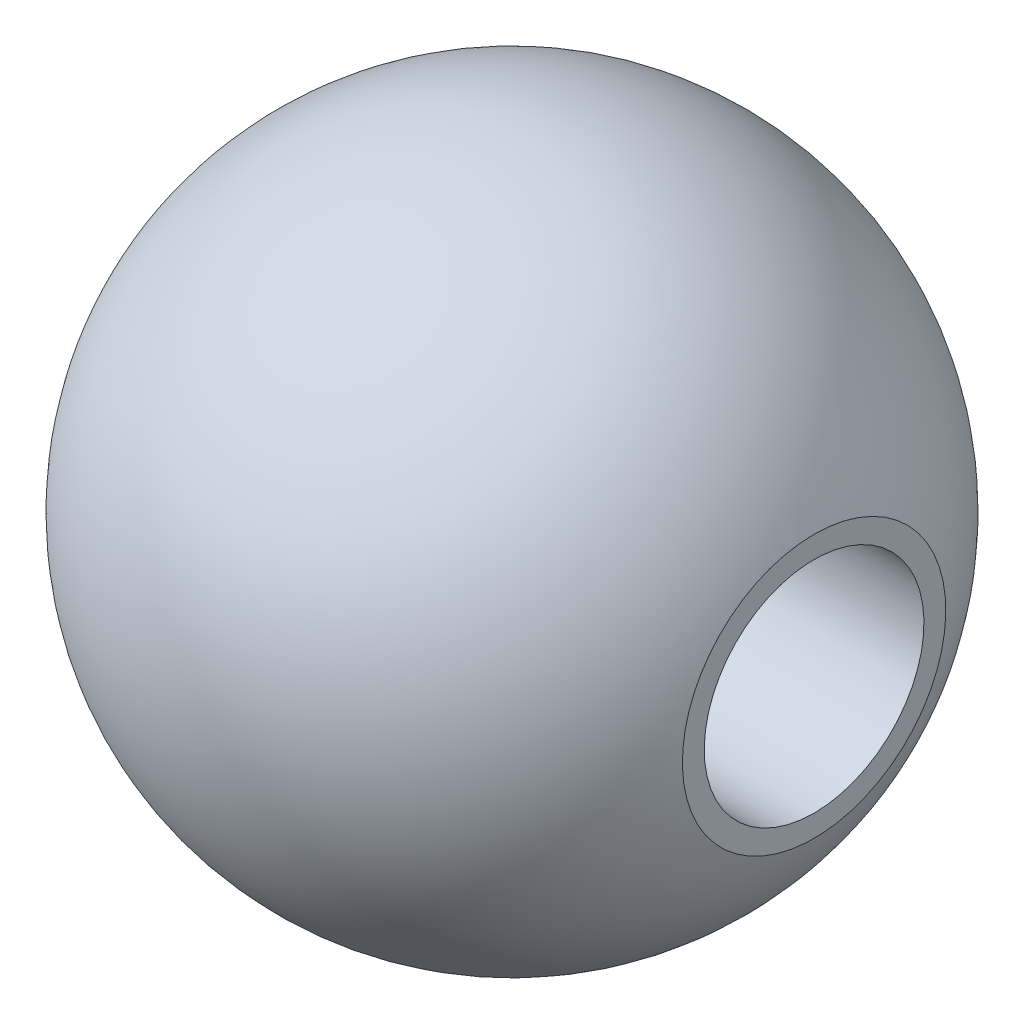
ISO-10303-21;
HEADER;
FILE_DESCRIPTION(('STEP AP214'),'2;1');
FILE_NAME('part.step','',(''),(''),'','','');
FILE_SCHEMA(('AUTOMOTIVE_DESIGN { 1 0 10303 214 1 1 1 1 }'));
ENDSEC;
DATA;
#1=APPLICATION_CONTEXT('core data for automotive mechanical design processes');
#2=APPLICATION_PROTOCOL_DEFINITION('international standard','automotive_design',2000,#1);
#3=PRODUCT_CONTEXT('',#1,'mechanical');
#4=PRODUCT('Part','Part','',(#3));
#5=PRODUCT_RELATED_PRODUCT_CATEGORY('part','',(#4));
#6=PRODUCT_DEFINITION_FORMATION('','',#4);
#7=PRODUCT_DEFINITION_CONTEXT('part definition',#1,'design');
#8=PRODUCT_DEFINITION('design','',#6,#7);
#9=PRODUCT_DEFINITION_SHAPE('','',#8);
#10=(LENGTH_UNIT() NAMED_UNIT(*) SI_UNIT(.MILLI.,.METRE.));
#11=(NAMED_UNIT(*) PLANE_ANGLE_UNIT() SI_UNIT($,.RADIAN.));
#12=(NAMED_UNIT(*) SI_UNIT($,.STERADIAN.) SOLID_ANGLE_UNIT());
#13=UNCERTAINTY_MEASURE_WITH_UNIT(LENGTH_MEASURE(1.E-05),#10,'distance_accuracy_value','');
#14=(GEOMETRIC_REPRESENTATION_CONTEXT(3) GLOBAL_UNCERTAINTY_ASSIGNED_CONTEXT((#13)) GLOBAL_UNIT_ASSIGNED_CONTEXT((#10,
#11,#12)) REPRESENTATION_CONTEXT('',''));
#15=CARTESIAN_POINT('',(0.,0.,0.));
#16=DIRECTION('',(0.,0.,1.));
#17=DIRECTION('',(1.,0.,0.));
#18=AXIS2_PLACEMENT_3D('',#15,#16,#17);
#19=CARTESIAN_POINT('',(5.49999999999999,0.,0.));
#20=DIRECTION('',(-1.,0.,0.));
#21=DIRECTION('',(0.,-1.,0.));
#22=AXIS2_PLACEMENT_3D('',#19,#20,#21);
#23=PLANE('',#22);
#24=CARTESIAN_POINT('',(5.49999999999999,0.,0.));
#25=DIRECTION('',(-1.,0.,0.));
#26=DIRECTION('',(0.,-1.,0.));
#27=AXIS2_PLACEMENT_3D('',#24,#25,#26);
#28=CIRCLE('',#27,2.39791576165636);
#29=CARTESIAN_POINT('',(5.49999999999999,2.39791576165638,0.));
#30=VERTEX_POINT('',#29);
#31=EDGE_CURVE('E10',#30,#30,#28,.T.);
#32=ORIENTED_EDGE('',*,*,#31,.F.);
#33=EDGE_LOOP('',(#32));
#34=FACE_BOUND('',#33,.T.);
#35=CARTESIAN_POINT('',(5.49999999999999,0.,0.));
#36=DIRECTION('',(-1.,0.,0.));
#37=DIRECTION('',(0.,-1.,0.));
#38=AXIS2_PLACEMENT_3D('',#35,#36,#37);
#39=CIRCLE('',#38,2.);
#40=CARTESIAN_POINT('',(5.49999999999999,-2.00000000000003,0.));
#41=VERTEX_POINT('',#40);
#42=EDGE_CURVE('E40',#41,#41,#39,.T.);
#43=ORIENTED_EDGE('',*,*,#42,.T.);
#44=EDGE_LOOP('',(#43));
#45=FACE_BOUND('',#44,.T.);
#46=ADVANCED_FACE('F30',(#34,#45),#23,.F.);
#47=CARTESIAN_POINT('',(0.,0.,0.));
#48=DIRECTION('',(-1.,0.,0.));
#49=DIRECTION('',(0.,1.,0.));
#50=AXIS2_PLACEMENT_3D('',#47,#48,#49);
#51=SPHERICAL_SURFACE('',#50,6.);
#52=CARTESIAN_POINT('',(-5.30431868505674,0.,0.));
#53=DIRECTION('',(1.,0.,0.));
#54=DIRECTION('',(0.,1.,0.));
#55=AXIS2_PLACEMENT_3D('',#52,#53,#54);
#56=CIRCLE('',#55,2.80431868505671);
#57=CARTESIAN_POINT('',(-5.30431868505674,2.80431868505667,0.));
#58=VERTEX_POINT('',#57);
#59=EDGE_CURVE('E33',#58,#58,#56,.F.);
#60=CARTESIAN_POINT('',(5.49999999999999,2.39791576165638,0.));
#61=CARTESIAN_POINT('',(5.44395336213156,2.52648929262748,0.));
#62=CARTESIAN_POINT('',(5.38338332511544,2.6530895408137,0.));
#63=CARTESIAN_POINT('',(5.25352800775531,2.90173874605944,0.));
#64=CARTESIAN_POINT('',(5.1842427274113,3.02378770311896,0.));
#65=CARTESIAN_POINT('',(5.0372884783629,3.26272960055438,0.));
#66=CARTESIAN_POINT('',(4.95961950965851,3.37962254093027,0.));
#67=CARTESIAN_POINT('',(4.7962821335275,3.60767902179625,0.));
#68=CARTESIAN_POINT('',(4.71061372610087,3.71884256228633,0.));
#69=CARTESIAN_POINT('',(4.53169797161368,3.93489341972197,0.));
#70=CARTESIAN_POINT('',(4.43845062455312,4.03978073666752,0.));
#71=CARTESIAN_POINT('',(4.24483557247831,4.24276360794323,0.));
#72=CARTESIAN_POINT('',(4.14446786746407,4.3408591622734,0.));
#73=CARTESIAN_POINT('',(3.93710546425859,4.52977624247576,0.));
#74=CARTESIAN_POINT('',(3.83011076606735,4.62059776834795,0.));
#75=CARTESIAN_POINT('',(3.61002037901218,4.79452031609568,0.));
#76=CARTESIAN_POINT('',(3.49692469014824,4.87762133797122,0.));
#77=CARTESIAN_POINT('',(3.26518830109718,5.03569434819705,0.));
#78=CARTESIAN_POINT('',(3.14654760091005,5.11066633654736,0.));
#79=CARTESIAN_POINT('',(2.90430443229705,5.25211271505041,0.));
#80=CARTESIAN_POINT('',(2.78070196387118,5.31858710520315,0.));
#81=CARTESIAN_POINT('',(2.52914289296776,5.4427114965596,0.));
#82=CARTESIAN_POINT('',(2.40118629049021,5.5003614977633,0.));
#83=CARTESIAN_POINT('',(2.14154799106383,5.6065537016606,0.));
#84=CARTESIAN_POINT('',(2.00986629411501,5.65509590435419,0.));
#85=CARTESIAN_POINT('',(1.74342515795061,5.74283387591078,0.));
#86=CARTESIAN_POINT('',(1.60866571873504,5.78202964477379,0.));
#87=CARTESIAN_POINT('',(1.33673158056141,5.85088206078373,0.));
#88=CARTESIAN_POINT('',(1.19955688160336,5.88053870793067,0.));
#89=CARTESIAN_POINT('',(0.92346657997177,5.93016708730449,0.));
#90=CARTESIAN_POINT('',(0.78455097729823,5.95013881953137,0.));
#91=CARTESIAN_POINT('',(0.505661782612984,5.98029918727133,0.));
#92=CARTESIAN_POINT('',(0.365688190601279,5.99048782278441,0.));
#93=CARTESIAN_POINT('',(0.085371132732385,6.00103190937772,0.));
#94=CARTESIAN_POINT('',(-0.0549723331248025,6.00138736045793,0.));
#95=CARTESIAN_POINT('',(-0.335339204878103,5.99226333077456,0.));
#96=CARTESIAN_POINT('',(-0.475362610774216,5.98278385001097,0.));
#97=CARTESIAN_POINT('',(-0.754401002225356,5.95403655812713,0.));
#98=CARTESIAN_POINT('',(-0.893415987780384,5.93476874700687,0.));
#99=CARTESIAN_POINT('',(-1.16975413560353,5.88653951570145,0.));
#100=CARTESIAN_POINT('',(-1.30707729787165,5.85757809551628,0.));
#101=CARTESIAN_POINT('',(-1.57935671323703,5.79010402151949,0.));
#102=CARTESIAN_POINT('',(-1.7143129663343,5.75159136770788,0.));
#103=CARTESIAN_POINT('',(-1.98119511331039,5.66520415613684,0.));
#104=CARTESIAN_POINT('',(-2.11312100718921,5.61732959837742,0.));
#105=CARTESIAN_POINT('',(-2.37329388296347,5.51245393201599,0.));
#106=CARTESIAN_POINT('',(-2.5015408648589,5.45545282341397,0.));
#107=CARTESIAN_POINT('',(-2.75372544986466,5.33260427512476,0.));
#108=CARTESIAN_POINT('',(-2.87766305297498,5.26675683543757,0.));
#109=CARTESIAN_POINT('',(-3.12061959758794,5.12653933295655,0.));
#110=CARTESIAN_POINT('',(-3.23963853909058,5.05216927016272,0.));
#111=CARTESIAN_POINT('',(-3.47217266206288,4.89527212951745,0.));
#112=CARTESIAN_POINT('',(-3.58568784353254,4.812745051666,0.));
#113=CARTESIAN_POINT('',(-3.80665638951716,4.63993957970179,0.));
#114=CARTESIAN_POINT('',(-3.91410975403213,4.54966118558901,0.));
#115=CARTESIAN_POINT('',(-4.1224264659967,4.36179692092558,0.));
#116=CARTESIAN_POINT('',(-4.2232898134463,4.26421105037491,0.));
#117=CARTESIAN_POINT('',(-4.41793047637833,4.06221146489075,0.));
#118=CARTESIAN_POINT('',(-4.51170779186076,3.95779774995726,0.));
#119=CARTESIAN_POINT('',(-4.691716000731,3.74265616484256,0.));
#120=CARTESIAN_POINT('',(-4.77794689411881,3.63192829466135,0.));
#121=CARTESIAN_POINT('',(-4.94243602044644,3.40470129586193,0.));
#122=CARTESIAN_POINT('',(-5.02069425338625,3.28820216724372,0.));
#123=CARTESIAN_POINT('',(-5.16886201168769,3.05001076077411,0.));
#124=CARTESIAN_POINT('',(-5.23877153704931,2.92831848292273,0.));
#125=CARTESIAN_POINT('',(-5.30431868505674,2.80431868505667,0.));
#126=B_SPLINE_CURVE_WITH_KNOTS('',3,(#60,#61,#62,#63,#64,#65,#66,#67,#68,#69,#70,#71,#72,#73,
#74,#75,#76,#77,#78,#79,#80,#81,#82,#83,#84,#85,#86,#87,#88,#89,#90,#91,#92,#93,#94,#95,#96,#97,
#98,#99,#100,#101,#102,#103,#104,#105,#106,#107,#108,#109,#110,#111,#112,#113,#114,#115,#116,
#117,#118,#119,#120,#121,#122,#123,#124,#125),.UNSPECIFIED.,.F.,.F.,(4,2,2,2,2,2,2,2,2,2,2,2,2,
2,2,2,2,2,2,2,2,2,2,2,2,2,2,2,2,2,2,2,4),(0.,0.420686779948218,0.841373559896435,
1.26206033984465,1.68274711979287,2.10343389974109,2.5241206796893,2.94480745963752,
3.36549423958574,3.78618101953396,4.20686779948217,4.62755457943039,5.04824135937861,
5.46892813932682,5.88961491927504,6.31030169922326,6.73098847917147,7.15167525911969,
7.57236203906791,7.99304881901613,8.41373559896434,8.83442237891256,9.25510915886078,
9.675795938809,10.0964827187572,10.5171694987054,10.9378562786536,11.3585430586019,
11.7792298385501,12.1999166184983,12.6206033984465,13.0412901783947,13.4619769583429),.UNSPECIFIED.);
#127=EDGE_CURVE('BSEAM54',#30,#58,#126,.T.);
#128=ORIENTED_EDGE('',*,*,#31,.T.);
#129=ORIENTED_EDGE('',*,*,#59,.F.);
#130=ORIENTED_EDGE('',*,*,#127,.T.);
#131=ORIENTED_EDGE('',*,*,#127,.F.);
#132=EDGE_LOOP('',(#128,#130,#129,#131));
#133=FACE_BOUND('',#132,.T.);
#134=ADVANCED_FACE('F54',(#133),#51,.T.);
#135=CARTESIAN_POINT('',(-4.49999999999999,0.,0.));
#136=DIRECTION('',(-1.,0.,0.));
#137=DIRECTION('',(0.,-1.,0.));
#138=AXIS2_PLACEMENT_3D('',#135,#136,#137);
#139=CONICAL_SURFACE('',#138,2.,0.785398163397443);
#140=CARTESIAN_POINT('',(-4.49999999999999,0.,0.));
#141=DIRECTION('',(-1.,0.,0.));
#142=DIRECTION('',(0.,-1.,0.));
#143=AXIS2_PLACEMENT_3D('',#140,#141,#142);
#144=CIRCLE('',#143,2.);
#145=CARTESIAN_POINT('',(-4.49999999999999,-2.00000000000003,0.));
#146=VERTEX_POINT('',#145);
#147=EDGE_CURVE('E44',#146,#146,#144,.T.);
#148=ORIENTED_EDGE('',*,*,#147,.F.);
#149=EDGE_LOOP('',(#148));
#150=FACE_BOUND('',#149,.T.);
#151=ORIENTED_EDGE('',*,*,#59,.T.);
#152=EDGE_LOOP('',(#151));
#153=FACE_BOUND('',#152,.T.);
#154=ADVANCED_FACE('F51',(#150,#153),#139,.F.);
#155=CARTESIAN_POINT('',(-5.50000000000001,0.,0.));
#156=DIRECTION('',(-1.,0.,0.));
#157=DIRECTION('',(0.,-1.,0.));
#158=AXIS2_PLACEMENT_3D('',#155,#156,#157);
#159=CYLINDRICAL_SURFACE('',#158,2.);
#160=CARTESIAN_POINT('',(-4.49999999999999,-2.00000000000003,0.));
#161=CARTESIAN_POINT('',(-4.39583333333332,-2.00000000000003,0.));
#162=CARTESIAN_POINT('',(-4.29166666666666,-2.00000000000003,0.));
#163=CARTESIAN_POINT('',(-4.08333333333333,-2.00000000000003,0.));
#164=CARTESIAN_POINT('',(-3.97916666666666,-2.00000000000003,0.));
#165=CARTESIAN_POINT('',(-3.77083333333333,-2.00000000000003,0.));
#166=CARTESIAN_POINT('',(-3.66666666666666,-2.00000000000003,0.));
#167=CARTESIAN_POINT('',(-3.45833333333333,-2.00000000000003,0.));
#168=CARTESIAN_POINT('',(-3.35416666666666,-2.00000000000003,0.));
#169=CARTESIAN_POINT('',(-3.14583333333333,-2.00000000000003,0.));
#170=CARTESIAN_POINT('',(-3.04166666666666,-2.00000000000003,0.));
#171=CARTESIAN_POINT('',(-2.83333333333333,-2.00000000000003,0.));
#172=CARTESIAN_POINT('',(-2.72916666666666,-2.00000000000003,0.));
#173=CARTESIAN_POINT('',(-2.52083333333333,-2.00000000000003,0.));
#174=CARTESIAN_POINT('',(-2.41666666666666,-2.00000000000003,0.));
#175=CARTESIAN_POINT('',(-2.20833333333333,-2.00000000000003,0.));
#176=CARTESIAN_POINT('',(-2.10416666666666,-2.00000000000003,0.));
#177=CARTESIAN_POINT('',(-1.89583333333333,-2.00000000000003,0.));
#178=CARTESIAN_POINT('',(-1.79166666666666,-2.00000000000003,0.));
#179=CARTESIAN_POINT('',(-1.58333333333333,-2.00000000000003,0.));
#180=CARTESIAN_POINT('',(-1.47916666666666,-2.00000000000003,0.));
#181=CARTESIAN_POINT('',(-1.27083333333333,-2.00000000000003,0.));
#182=CARTESIAN_POINT('',(-1.16666666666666,-2.00000000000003,0.));
#183=CARTESIAN_POINT('',(-0.958333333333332,-2.00000000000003,0.));
#184=CARTESIAN_POINT('',(-0.854166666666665,-2.00000000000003,0.));
#185=CARTESIAN_POINT('',(-0.645833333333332,-2.00000000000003,0.));
#186=CARTESIAN_POINT('',(-0.541666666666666,-2.00000000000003,0.));
#187=CARTESIAN_POINT('',(-0.333333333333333,-2.00000000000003,0.));
#188=CARTESIAN_POINT('',(-0.229166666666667,-2.00000000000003,0.));
#189=CARTESIAN_POINT('',(-0.0208333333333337,-2.00000000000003,0.));
#190=CARTESIAN_POINT('',(0.0833333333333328,-2.00000000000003,0.));
#191=CARTESIAN_POINT('',(0.291666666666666,-2.00000000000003,0.));
#192=CARTESIAN_POINT('',(0.395833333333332,-2.00000000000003,0.));
#193=CARTESIAN_POINT('',(0.604166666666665,-2.00000000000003,0.));
#194=CARTESIAN_POINT('',(0.708333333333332,-2.00000000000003,0.));
#195=CARTESIAN_POINT('',(0.916666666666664,-2.00000000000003,0.));
#196=CARTESIAN_POINT('',(1.02083333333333,-2.00000000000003,0.));
#197=CARTESIAN_POINT('',(1.22916666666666,-2.00000000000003,0.));
#198=CARTESIAN_POINT('',(1.33333333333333,-2.00000000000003,0.));
#199=CARTESIAN_POINT('',(1.54166666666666,-2.00000000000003,0.));
#200=CARTESIAN_POINT('',(1.64583333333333,-2.00000000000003,0.));
#201=CARTESIAN_POINT('',(1.85416666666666,-2.00000000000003,0.));
#202=CARTESIAN_POINT('',(1.95833333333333,-2.00000000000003,0.));
#203=CARTESIAN_POINT('',(2.16666666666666,-2.00000000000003,0.));
#204=CARTESIAN_POINT('',(2.27083333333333,-2.00000000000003,0.));
#205=CARTESIAN_POINT('',(2.47916666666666,-2.00000000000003,0.));
#206=CARTESIAN_POINT('',(2.58333333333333,-2.00000000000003,0.));
#207=CARTESIAN_POINT('',(2.79166666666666,-2.00000000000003,0.));
#208=CARTESIAN_POINT('',(2.89583333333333,-2.00000000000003,0.));
#209=CARTESIAN_POINT('',(3.10416666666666,-2.00000000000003,0.));
#210=CARTESIAN_POINT('',(3.20833333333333,-2.00000000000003,0.));
#211=CARTESIAN_POINT('',(3.41666666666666,-2.00000000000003,0.));
#212=CARTESIAN_POINT('',(3.52083333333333,-2.00000000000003,0.));
#213=CARTESIAN_POINT('',(3.72916666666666,-2.00000000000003,0.));
#214=CARTESIAN_POINT('',(3.83333333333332,-2.00000000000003,0.));
#215=CARTESIAN_POINT('',(4.04166666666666,-2.00000000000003,0.));
#216=CARTESIAN_POINT('',(4.14583333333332,-2.00000000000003,0.));
#217=CARTESIAN_POINT('',(4.35416666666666,-2.00000000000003,0.));
#218=CARTESIAN_POINT('',(4.45833333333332,-2.00000000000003,0.));
#219=CARTESIAN_POINT('',(4.66666666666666,-2.00000000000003,0.));
#220=CARTESIAN_POINT('',(4.77083333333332,-2.00000000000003,0.));
#221=CARTESIAN_POINT('',(4.97916666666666,-2.00000000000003,0.));
#222=CARTESIAN_POINT('',(5.08333333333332,-2.00000000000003,0.));
#223=CARTESIAN_POINT('',(5.29166666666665,-2.00000000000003,0.));
#224=CARTESIAN_POINT('',(5.39583333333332,-2.00000000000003,0.));
#225=CARTESIAN_POINT('',(5.49999999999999,-2.00000000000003,0.));
#226=B_SPLINE_CURVE_WITH_KNOTS('',3,(#160,#161,#162,#163,#164,#165,#166,#167,#168,#169,#170,
#171,#172,#173,#174,#175,#176,#177,#178,#179,#180,#181,#182,#183,#184,#185,#186,#187,#188,#189,
#190,#191,#192,#193,#194,#195,#196,#197,#198,#199,#200,#201,#202,#203,#204,#205,#206,#207,#208,
#209,#210,#211,#212,#213,#214,#215,#216,#217,#218,#219,#220,#221,#222,#223,#224,#225),
.UNSPECIFIED.,.F.,.F.,(4,2,2,2,2,2,2,2,2,2,2,2,2,2,2,2,2,2,2,2,2,2,2,2,2,2,2,2,2,2,2,2,4),(0.,
0.312499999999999,0.624999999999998,0.937499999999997,1.25,1.5625,1.875,2.1875,2.49999999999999,
2.81249999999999,3.12499999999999,3.43749999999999,3.74999999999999,4.06249999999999,
4.37499999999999,4.68749999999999,4.99999999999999,5.31249999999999,5.62499999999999,
5.93749999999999,6.24999999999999,6.56249999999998,6.87499999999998,7.18749999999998,
7.49999999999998,7.81249999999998,8.12499999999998,8.43749999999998,8.74999999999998,
9.06249999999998,9.37499999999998,9.68749999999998,9.99999999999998),.UNSPECIFIED.);
#227=EDGE_CURVE('BSEAM48',#146,#41,#226,.T.);
#228=ORIENTED_EDGE('',*,*,#147,.T.);
#229=ORIENTED_EDGE('',*,*,#42,.F.);
#230=ORIENTED_EDGE('',*,*,#227,.T.);
#231=ORIENTED_EDGE('',*,*,#227,.F.);
#232=EDGE_LOOP('',(#228,#230,#229,#231));
#233=FACE_BOUND('',#232,.T.);
#234=ADVANCED_FACE('F48',(#233),#159,.F.);
#235=CLOSED_SHELL('',(#46,#134,#154,#234));
#236=MANIFOLD_SOLID_BREP('B2',#235);
#237=ADVANCED_BREP_SHAPE_REPRESENTATION('',(#18,#236),#14);
#238=SHAPE_DEFINITION_REPRESENTATION(#9,#237);
ENDSEC;
END-ISO-10303-21;
